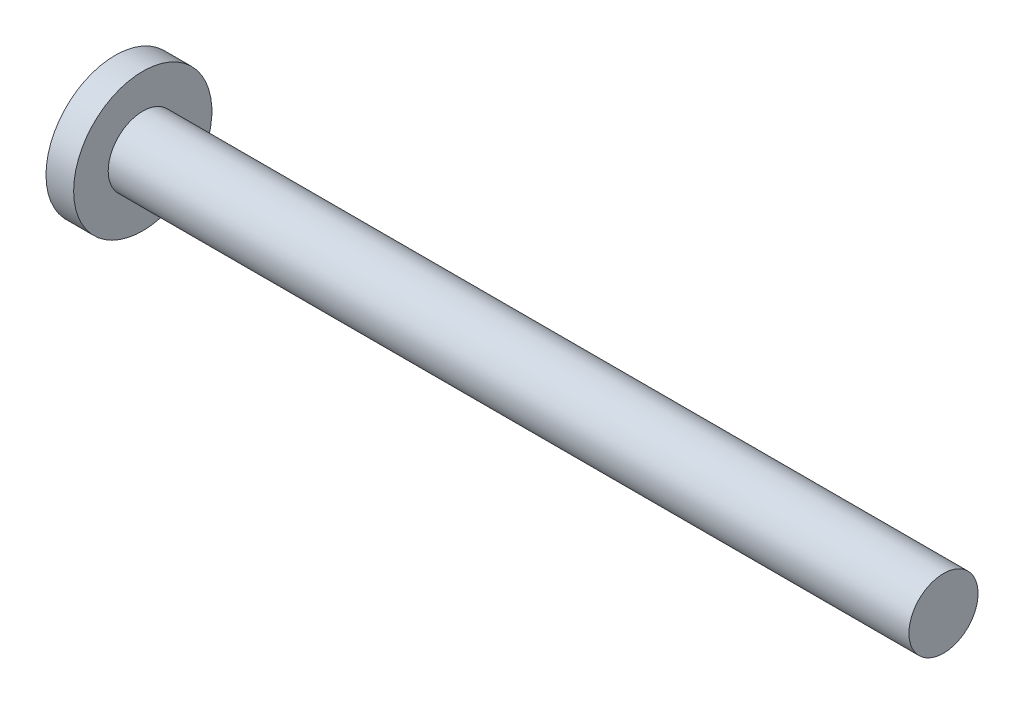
from build123d import *


with BuildPart() as part:
    # Sketch1 → Revolve1 (revolve)
    with BuildSketch(Plane.XY, mode=Mode.PRIVATE) as revolve1_sk:
        Polygon((0, 0), (0, 3.3909), (1.35636, 3.3909), (1.35636, 1.69545), (40.64, 1.69545), (40.64, 0), align=None)
    revolve(revolve1_sk.sketch.rotate(Axis((40.64, 0, 0), (-1, 0, 0)), 270), axis=Axis((40.64, 0, 0), (-1, 0, 0)))


solid = part.part
